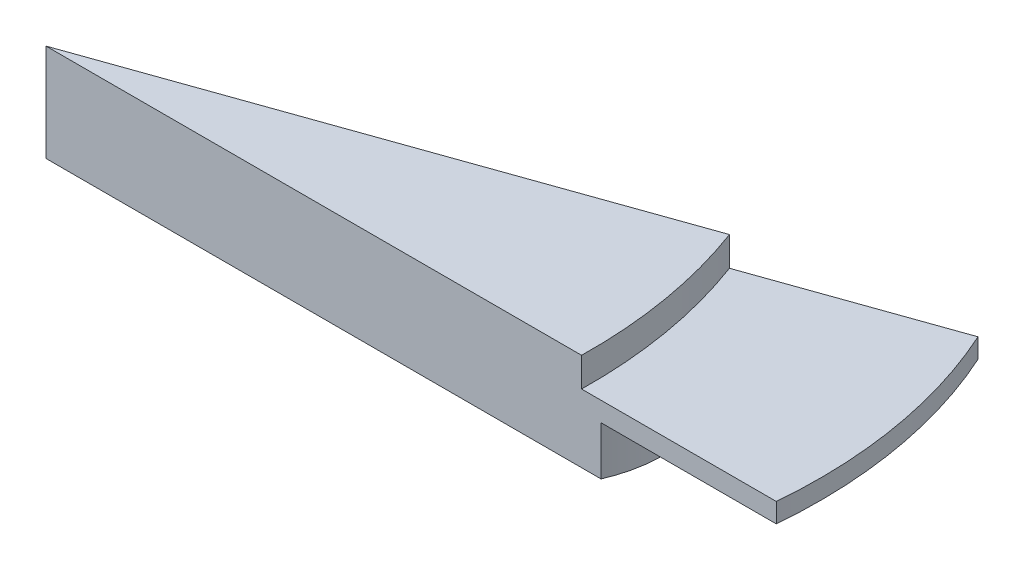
from build123d import *

# Parameters (mm, degrees)
BOSS_EXTRUDE1_DEPTH = 10
CUT_EXTRUDE1_START  = -3
CUT_EXTRUDE1_DEPTH  = 3
CUT_EXTRUDE2_DEPTH  = 5


with BuildPart() as part:
    # Sketch1 → Boss-Extrude1 (new body)
    with BuildSketch(Plane(origin=(0, 0, 0), x_dir=(1, 0, 0), z_dir=(0, 1, 0))):
        with BuildLine():
            Line((0, 0), (75, 0))
            ThreePointArc((75, 0), (74.467024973, 12.776521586), (70.710678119, 25))
            Line((70.710678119, 25), (0, 0))
        make_face()
    extrude(amount=BOSS_EXTRUDE1_DEPTH)

    # Sketch2 → Cut-Extrude1 (cut)
    with BuildSketch(Plane(origin=(0, 10, 0), x_dir=(1, 0, 0), z_dir=(0, 1, 0)).offset(CUT_EXTRUDE1_START)):
        with BuildLine():
            Line((51.854497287, 18.333333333), (70.710678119, 25))
            ThreePointArc((70.710678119, 25), (74.467024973, 12.776521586), (75, 0))
            Line((75, 0), (55, 0))
            ThreePointArc((55, 0), (54.287309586, 9.314229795), (51.854497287, 18.333333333))
        make_face()
    extrude(amount=CUT_EXTRUDE1_DEPTH, mode=Mode.SUBTRACT)

    # Sketch3 → Cut-Extrude2 (cut)
    with BuildSketch(Plane.XZ):
        with BuildLine():
            Line((57, 0), (75, 0))
            ThreePointArc((75, 0), (74.467024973, -12.776521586), (70.710678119, -25))
            Line((70.710678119, -25), (49.968879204, -17.666666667))
            ThreePointArc((49.968879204, -17.666666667), (57.152737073, -10.293271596), (57, 0))
        make_face()
    extrude(amount=-CUT_EXTRUDE2_DEPTH, mode=Mode.SUBTRACT)


solid = part.part
